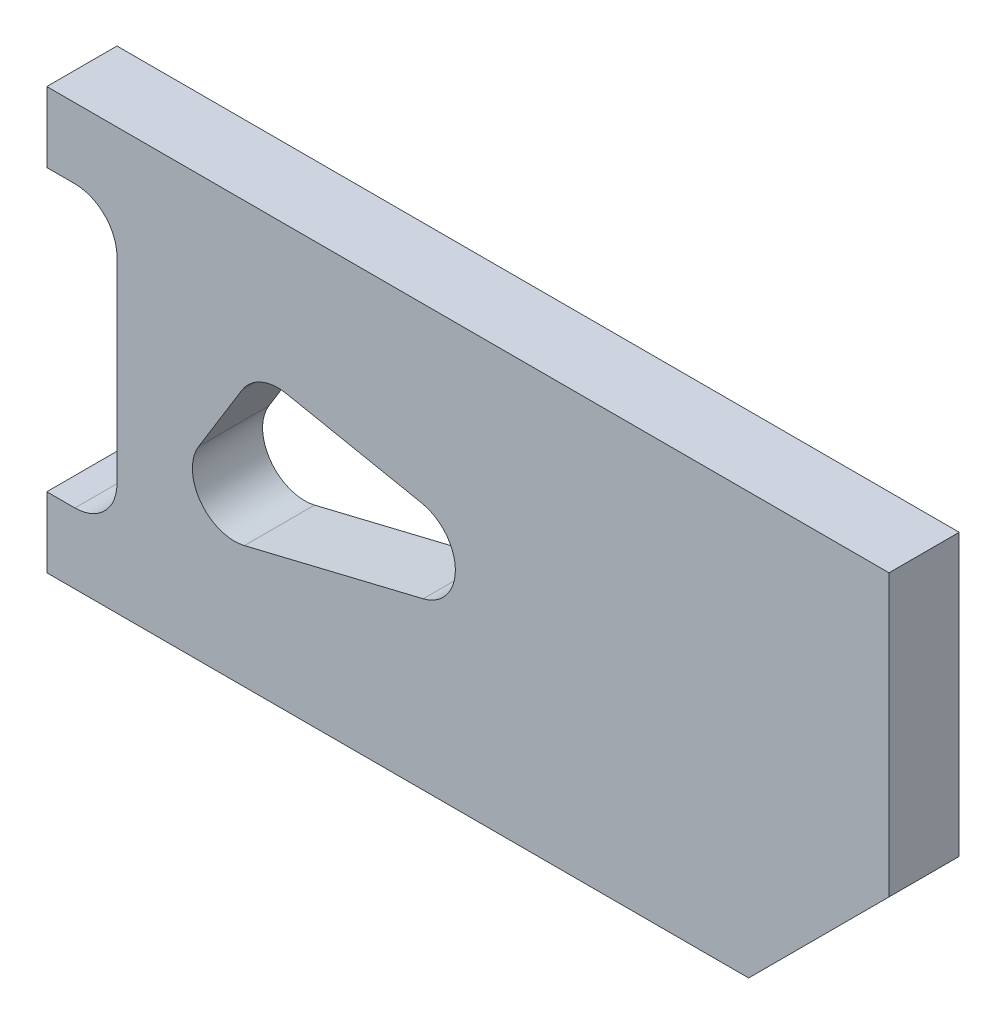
ISO-10303-21;
HEADER;
FILE_DESCRIPTION(('STEP AP214'),'2;1');
FILE_NAME('part.step','',(''),(''),'','','');
FILE_SCHEMA(('AUTOMOTIVE_DESIGN { 1 0 10303 214 1 1 1 1 }'));
ENDSEC;
DATA;
#1=APPLICATION_CONTEXT('core data for automotive mechanical design processes');
#2=APPLICATION_PROTOCOL_DEFINITION('international standard','automotive_design',2000,#1);
#3=PRODUCT_CONTEXT('',#1,'mechanical');
#4=PRODUCT('Part','Part','',(#3));
#5=PRODUCT_RELATED_PRODUCT_CATEGORY('part','',(#4));
#6=PRODUCT_DEFINITION_FORMATION('','',#4);
#7=PRODUCT_DEFINITION_CONTEXT('part definition',#1,'design');
#8=PRODUCT_DEFINITION('design','',#6,#7);
#9=PRODUCT_DEFINITION_SHAPE('','',#8);
#10=(LENGTH_UNIT() NAMED_UNIT(*) SI_UNIT(.MILLI.,.METRE.));
#11=(NAMED_UNIT(*) PLANE_ANGLE_UNIT() SI_UNIT($,.RADIAN.));
#12=(NAMED_UNIT(*) SI_UNIT($,.STERADIAN.) SOLID_ANGLE_UNIT());
#13=UNCERTAINTY_MEASURE_WITH_UNIT(LENGTH_MEASURE(1.E-05),#10,'distance_accuracy_value','');
#14=(GEOMETRIC_REPRESENTATION_CONTEXT(3) GLOBAL_UNCERTAINTY_ASSIGNED_CONTEXT((#13)) GLOBAL_UNIT_ASSIGNED_CONTEXT((#10,
#11,#12)) REPRESENTATION_CONTEXT('',''));
#15=CARTESIAN_POINT('',(0.,0.,0.));
#16=DIRECTION('',(0.,0.,1.));
#17=DIRECTION('',(1.,0.,0.));
#18=AXIS2_PLACEMENT_3D('',#15,#16,#17);
#19=CARTESIAN_POINT('',(26.107661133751,14.7190560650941,5.));
#20=DIRECTION('',(0.,0.,-1.));
#21=DIRECTION('',(-1.,0.,0.));
#22=AXIS2_PLACEMENT_3D('',#19,#20,#21);
#23=CYLINDRICAL_SURFACE('',#22,3.);
#24=CARTESIAN_POINT('',(26.107661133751,14.7190560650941,0.));
#25=DIRECTION('',(0.,0.,1.));
#26=DIRECTION('',(1.,0.,0.));
#27=AXIS2_PLACEMENT_3D('',#24,#25,#26);
#28=CIRCLE('',#27,3.);
#29=CARTESIAN_POINT('',(26.8144612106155,11.803505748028,0.));
#30=VERTEX_POINT('',#29);
#31=CARTESIAN_POINT('',(26.6960095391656,17.6607980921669,0.));
#32=VERTEX_POINT('',#31);
#33=EDGE_CURVE('E220',#30,#32,#28,.T.);
#34=ORIENTED_EDGE('',*,*,#33,.F.);
#35=DIRECTION('',(0.,0.,-1.));
#36=VECTOR('',#35,1.);
#37=CARTESIAN_POINT('',(26.8144612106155,11.803505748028,5.));
#38=LINE('',#37,#36);
#39=CARTESIAN_POINT('',(26.8144612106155,11.803505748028,5.));
#40=VERTEX_POINT('',#39);
#41=EDGE_CURVE('E11',#40,#30,#38,.T.);
#42=ORIENTED_EDGE('',*,*,#41,.F.);
#43=CARTESIAN_POINT('',(26.107661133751,14.7190560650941,5.));
#44=DIRECTION('',(0.,0.,1.));
#45=DIRECTION('',(1.,0.,0.));
#46=AXIS2_PLACEMENT_3D('',#43,#44,#45);
#47=CIRCLE('',#46,3.);
#48=CARTESIAN_POINT('',(26.6960095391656,17.6607980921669,5.));
#49=VERTEX_POINT('',#48);
#50=EDGE_CURVE('E309',#40,#49,#47,.T.);
#51=ORIENTED_EDGE('',*,*,#50,.T.);
#52=DIRECTION('',(0.,0.,-1.));
#53=VECTOR('',#52,1.);
#54=CARTESIAN_POINT('',(26.6960095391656,17.6607980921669,5.));
#55=LINE('',#54,#53);
#56=EDGE_CURVE('E117',#49,#32,#55,.T.);
#57=ORIENTED_EDGE('',*,*,#56,.T.);
#58=EDGE_LOOP('',(#34,#42,#51,#57));
#59=FACE_BOUND('',#58,.T.);
#60=ADVANCED_FACE('F37',(#59),#23,.F.);
#61=CARTESIAN_POINT('',(-1.21422376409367,5.00867302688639,5.));
#62=DIRECTION('',(0.235600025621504,-0.971850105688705,0.));
#63=DIRECTION('',(0.971850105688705,0.235600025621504,0.));
#64=AXIS2_PLACEMENT_3D('',#61,#62,#63);
#65=PLANE('',#64);
#66=DIRECTION('',(-0.971850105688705,-0.235600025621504,0.));
#67=VECTOR('',#66,1.);
#68=CARTESIAN_POINT('',(-1.21422376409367,5.00867302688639,0.));
#69=LINE('',#68,#67);
#70=CARTESIAN_POINT('',(14.0797039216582,8.71629185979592,0.));
#71=VERTEX_POINT('',#70);
#72=EDGE_CURVE('E223',#30,#71,#69,.T.);
#73=ORIENTED_EDGE('',*,*,#72,.T.);
#74=DIRECTION('',(0.,0.,-1.));
#75=VECTOR('',#74,1.);
#76=CARTESIAN_POINT('',(14.0797039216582,8.71629185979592,5.));
#77=LINE('',#76,#75);
#78=CARTESIAN_POINT('',(14.0797039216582,8.71629185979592,5.));
#79=VERTEX_POINT('',#78);
#80=EDGE_CURVE('E47',#79,#71,#77,.T.);
#81=ORIENTED_EDGE('',*,*,#80,.F.);
#82=DIRECTION('',(-0.971850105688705,-0.235600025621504,0.));
#83=VECTOR('',#82,1.);
#84=CARTESIAN_POINT('',(-1.21422376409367,5.00867302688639,5.));
#85=LINE('',#84,#83);
#86=EDGE_CURVE('E311',#40,#79,#85,.T.);
#87=ORIENTED_EDGE('',*,*,#86,.F.);
#88=ORIENTED_EDGE('',*,*,#41,.T.);
#89=EDGE_LOOP('',(#73,#81,#87,#88));
#90=FACE_BOUND('',#89,.T.);
#91=ADVANCED_FACE('F315',(#90),#65,.F.);
#92=CARTESIAN_POINT('',(13.3729038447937,11.631842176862,5.));
#93=DIRECTION('',(0.,0.,-1.));
#94=DIRECTION('',(-1.,0.,0.));
#95=AXIS2_PLACEMENT_3D('',#92,#93,#94);
#96=CYLINDRICAL_SURFACE('',#95,3.);
#97=CARTESIAN_POINT('',(13.3729038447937,11.631842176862,0.));
#98=DIRECTION('',(0.,0.,1.));
#99=DIRECTION('',(1.,0.,0.));
#100=AXIS2_PLACEMENT_3D('',#97,#98,#99);
#101=CIRCLE('',#100,3.);
#102=CARTESIAN_POINT('',(10.81792889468,13.204134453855,0.));
#103=VERTEX_POINT('',#102);
#104=EDGE_CURVE('E226',#71,#103,#101,.F.);
#105=ORIENTED_EDGE('',*,*,#104,.T.);
#106=DIRECTION('',(0.,0.,-1.));
#107=VECTOR('',#106,1.);
#108=CARTESIAN_POINT('',(10.81792889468,13.204134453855,5.));
#109=LINE('',#108,#107);
#110=CARTESIAN_POINT('',(10.81792889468,13.204134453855,5.));
#111=VERTEX_POINT('',#110);
#112=EDGE_CURVE('E183',#111,#103,#109,.T.);
#113=ORIENTED_EDGE('',*,*,#112,.F.);
#114=CARTESIAN_POINT('',(13.3729038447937,11.631842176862,5.));
#115=DIRECTION('',(0.,0.,1.));
#116=DIRECTION('',(1.,0.,0.));
#117=AXIS2_PLACEMENT_3D('',#114,#115,#116);
#118=CIRCLE('',#117,3.);
#119=EDGE_CURVE('E171',#79,#111,#118,.F.);
#120=ORIENTED_EDGE('',*,*,#119,.F.);
#121=ORIENTED_EDGE('',*,*,#80,.T.);
#122=EDGE_LOOP('',(#105,#113,#120,#121));
#123=FACE_BOUND('',#122,.T.);
#124=ADVANCED_FACE('F318',(#123),#96,.F.);
#125=CARTESIAN_POINT('',(1.95278969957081,-1.20171673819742,5.));
#126=DIRECTION('',(-0.851658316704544,0.524097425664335,0.));
#127=DIRECTION('',(-0.524097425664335,-0.851658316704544,0.));
#128=AXIS2_PLACEMENT_3D('',#125,#126,#127);
#129=PLANE('',#128);
#130=DIRECTION('',(0.524097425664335,0.851658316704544,0.));
#131=VECTOR('',#130,1.);
#132=CARTESIAN_POINT('',(1.95278969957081,-1.20171673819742,0.));
#133=LINE('',#132,#131);
#134=CARTESIAN_POINT('',(13.9051427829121,18.2208570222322,0.));
#135=VERTEX_POINT('',#134);
#136=EDGE_CURVE('E179',#103,#135,#133,.T.);
#137=ORIENTED_EDGE('',*,*,#136,.T.);
#138=DIRECTION('',(0.,0.,-1.));
#139=VECTOR('',#138,1.);
#140=CARTESIAN_POINT('',(13.9051427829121,18.2208570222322,5.));
#141=LINE('',#140,#139);
#142=CARTESIAN_POINT('',(13.9051427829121,18.2208570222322,5.));
#143=VERTEX_POINT('',#142);
#144=EDGE_CURVE('E177',#143,#135,#141,.T.);
#145=ORIENTED_EDGE('',*,*,#144,.F.);
#146=DIRECTION('',(0.524097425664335,0.851658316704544,0.));
#147=VECTOR('',#146,1.);
#148=CARTESIAN_POINT('',(1.95278969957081,-1.20171673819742,5.));
#149=LINE('',#148,#147);
#150=EDGE_CURVE('E165',#111,#143,#149,.T.);
#151=ORIENTED_EDGE('',*,*,#150,.F.);
#152=ORIENTED_EDGE('',*,*,#112,.T.);
#153=EDGE_LOOP('',(#137,#145,#151,#152));
#154=FACE_BOUND('',#153,.T.);
#155=ADVANCED_FACE('F178',(#154),#129,.F.);
#156=CARTESIAN_POINT('',(16.4601177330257,16.6485647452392,5.));
#157=DIRECTION('',(0.,0.,-1.));
#158=DIRECTION('',(-1.,0.,0.));
#159=AXIS2_PLACEMENT_3D('',#156,#157,#158);
#160=CYLINDRICAL_SURFACE('',#159,3.);
#161=CARTESIAN_POINT('',(16.4601177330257,16.6485647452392,0.));
#162=DIRECTION('',(0.,0.,1.));
#163=DIRECTION('',(1.,0.,0.));
#164=AXIS2_PLACEMENT_3D('',#161,#162,#163);
#165=CIRCLE('',#164,3.);
#166=CARTESIAN_POINT('',(17.0484661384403,19.5903067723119,0.));
#167=VERTEX_POINT('',#166);
#168=EDGE_CURVE('E230',#167,#135,#165,.T.);
#169=ORIENTED_EDGE('',*,*,#168,.F.);
#170=DIRECTION('',(0.,0.,-1.));
#171=VECTOR('',#170,1.);
#172=CARTESIAN_POINT('',(17.0484661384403,19.5903067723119,5.));
#173=LINE('',#172,#171);
#174=CARTESIAN_POINT('',(17.0484661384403,19.5903067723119,5.));
#175=VERTEX_POINT('',#174);
#176=EDGE_CURVE('E110',#175,#167,#173,.T.);
#177=ORIENTED_EDGE('',*,*,#176,.F.);
#178=CARTESIAN_POINT('',(16.4601177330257,16.6485647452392,5.));
#179=DIRECTION('',(0.,0.,1.));
#180=DIRECTION('',(1.,0.,0.));
#181=AXIS2_PLACEMENT_3D('',#178,#179,#180);
#182=CIRCLE('',#181,3.);
#183=EDGE_CURVE('E169',#175,#143,#182,.T.);
#184=ORIENTED_EDGE('',*,*,#183,.T.);
#185=ORIENTED_EDGE('',*,*,#144,.T.);
#186=EDGE_LOOP('',(#169,#177,#184,#185));
#187=FACE_BOUND('',#186,.T.);
#188=ADVANCED_FACE('F185',(#187),#160,.F.);
#189=CARTESIAN_POINT('',(2.,8.,5.));
#190=DIRECTION('',(0.,0.,-1.));
#191=DIRECTION('',(-1.,0.,0.));
#192=AXIS2_PLACEMENT_3D('',#189,#190,#191);
#193=CYLINDRICAL_SURFACE('',#192,3.);
#194=CARTESIAN_POINT('',(2.,8.,0.));
#195=DIRECTION('',(0.,0.,1.));
#196=DIRECTION('',(1.,0.,0.));
#197=AXIS2_PLACEMENT_3D('',#194,#195,#196);
#198=CIRCLE('',#197,3.);
#199=CARTESIAN_POINT('',(2.,5.,0.));
#200=VERTEX_POINT('',#199);
#201=CARTESIAN_POINT('',(5.,8.,0.));
#202=VERTEX_POINT('',#201);
#203=EDGE_CURVE('E191',#200,#202,#198,.T.);
#204=ORIENTED_EDGE('',*,*,#203,.F.);
#205=DIRECTION('',(0.,0.,-1.));
#206=VECTOR('',#205,1.);
#207=CARTESIAN_POINT('',(2.,5.,5.));
#208=LINE('',#207,#206);
#209=CARTESIAN_POINT('',(2.,5.,5.));
#210=VERTEX_POINT('',#209);
#211=EDGE_CURVE('E41',#210,#200,#208,.T.);
#212=ORIENTED_EDGE('',*,*,#211,.F.);
#213=CARTESIAN_POINT('',(2.,8.,5.));
#214=DIRECTION('',(0.,0.,1.));
#215=DIRECTION('',(1.,0.,0.));
#216=AXIS2_PLACEMENT_3D('',#213,#214,#215);
#217=CIRCLE('',#216,3.);
#218=CARTESIAN_POINT('',(5.,8.,5.));
#219=VERTEX_POINT('',#218);
#220=EDGE_CURVE('E234',#210,#219,#217,.T.);
#221=ORIENTED_EDGE('',*,*,#220,.T.);
#222=DIRECTION('',(0.,0.,-1.));
#223=VECTOR('',#222,1.);
#224=CARTESIAN_POINT('',(5.,8.,5.));
#225=LINE('',#224,#223);
#226=EDGE_CURVE('E187',#219,#202,#225,.T.);
#227=ORIENTED_EDGE('',*,*,#226,.T.);
#228=EDGE_LOOP('',(#204,#212,#221,#227));
#229=FACE_BOUND('',#228,.T.);
#230=ADVANCED_FACE('F39',(#229),#193,.F.);
#231=CARTESIAN_POINT('',(0.,5.,5.));
#232=DIRECTION('',(0.,1.,0.));
#233=DIRECTION('',(0.,0.,1.));
#234=AXIS2_PLACEMENT_3D('',#231,#232,#233);
#235=PLANE('',#234);
#236=DIRECTION('',(1.,0.,0.));
#237=VECTOR('',#236,1.);
#238=CARTESIAN_POINT('',(0.,5.,0.));
#239=LINE('',#238,#237);
#240=CARTESIAN_POINT('',(0.,5.,0.));
#241=VERTEX_POINT('',#240);
#242=EDGE_CURVE('E194',#241,#200,#239,.T.);
#243=ORIENTED_EDGE('',*,*,#242,.F.);
#244=DIRECTION('',(0.,0.,-1.));
#245=VECTOR('',#244,1.);
#246=CARTESIAN_POINT('',(0.,5.,5.));
#247=LINE('',#246,#245);
#248=CARTESIAN_POINT('',(0.,5.,5.));
#249=VERTEX_POINT('',#248);
#250=EDGE_CURVE('E258',#249,#241,#247,.T.);
#251=ORIENTED_EDGE('',*,*,#250,.F.);
#252=DIRECTION('',(1.,0.,0.));
#253=VECTOR('',#252,1.);
#254=CARTESIAN_POINT('',(0.,5.,5.));
#255=LINE('',#254,#253);
#256=EDGE_CURVE('E267',#249,#210,#255,.T.);
#257=ORIENTED_EDGE('',*,*,#256,.T.);
#258=ORIENTED_EDGE('',*,*,#211,.T.);
#259=EDGE_LOOP('',(#243,#251,#257,#258));
#260=FACE_BOUND('',#259,.T.);
#261=ADVANCED_FACE('F265',(#260),#235,.T.);
#262=CARTESIAN_POINT('',(0.,0.,5.));
#263=DIRECTION('',(-1.,0.,0.));
#264=DIRECTION('',(0.,0.,1.));
#265=AXIS2_PLACEMENT_3D('',#262,#263,#264);
#266=PLANE('',#265);
#267=DIRECTION('',(0.,1.,0.));
#268=VECTOR('',#267,1.);
#269=CARTESIAN_POINT('',(0.,0.,0.));
#270=LINE('',#269,#268);
#271=CARTESIAN_POINT('',(0.,0.,0.));
#272=VERTEX_POINT('',#271);
#273=EDGE_CURVE('E197',#272,#241,#270,.T.);
#274=ORIENTED_EDGE('',*,*,#273,.F.);
#275=DIRECTION('',(0.,0.,-1.));
#276=VECTOR('',#275,1.);
#277=CARTESIAN_POINT('',(0.,0.,5.));
#278=LINE('',#277,#276);
#279=CARTESIAN_POINT('',(0.,0.,5.));
#280=VERTEX_POINT('',#279);
#281=EDGE_CURVE('E257',#280,#272,#278,.T.);
#282=ORIENTED_EDGE('',*,*,#281,.F.);
#283=DIRECTION('',(0.,1.,0.));
#284=VECTOR('',#283,1.);
#285=CARTESIAN_POINT('',(0.,0.,5.));
#286=LINE('',#285,#284);
#287=EDGE_CURVE('E278',#280,#249,#286,.T.);
#288=ORIENTED_EDGE('',*,*,#287,.T.);
#289=ORIENTED_EDGE('',*,*,#250,.T.);
#290=EDGE_LOOP('',(#274,#282,#288,#289));
#291=FACE_BOUND('',#290,.T.);
#292=ADVANCED_FACE('F275',(#291),#266,.T.);
#293=CARTESIAN_POINT('',(0.,0.,5.));
#294=DIRECTION('',(0.,1.,0.));
#295=DIRECTION('',(0.,0.,1.));
#296=AXIS2_PLACEMENT_3D('',#293,#294,#295);
#297=PLANE('',#296);
#298=DIRECTION('',(1.,0.,0.));
#299=VECTOR('',#298,1.);
#300=CARTESIAN_POINT('',(0.,0.,0.));
#301=LINE('',#300,#299);
#302=CARTESIAN_POINT('',(50.,0.,0.));
#303=VERTEX_POINT('',#302);
#304=EDGE_CURVE('E200',#272,#303,#301,.T.);
#305=ORIENTED_EDGE('',*,*,#304,.T.);
#306=DIRECTION('',(0.,0.,-1.));
#307=VECTOR('',#306,1.);
#308=CARTESIAN_POINT('',(50.,0.,5.));
#309=LINE('',#308,#307);
#310=CARTESIAN_POINT('',(50.,0.,5.));
#311=VERTEX_POINT('',#310);
#312=EDGE_CURVE('E254',#311,#303,#309,.T.);
#313=ORIENTED_EDGE('',*,*,#312,.F.);
#314=DIRECTION('',(1.,0.,0.));
#315=VECTOR('',#314,1.);
#316=CARTESIAN_POINT('',(0.,0.,5.));
#317=LINE('',#316,#315);
#318=EDGE_CURVE('E281',#280,#311,#317,.T.);
#319=ORIENTED_EDGE('',*,*,#318,.F.);
#320=ORIENTED_EDGE('',*,*,#281,.T.);
#321=EDGE_LOOP('',(#305,#313,#319,#320));
#322=FACE_BOUND('',#321,.T.);
#323=ADVANCED_FACE('F282',(#322),#297,.F.);
#324=CARTESIAN_POINT('',(25.,-25.,5.));
#325=DIRECTION('',(-0.707106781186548,0.707106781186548,0.));
#326=DIRECTION('',(-0.707106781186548,-0.707106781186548,0.));
#327=AXIS2_PLACEMENT_3D('',#324,#325,#326);
#328=PLANE('',#327);
#329=DIRECTION('',(0.707106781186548,0.707106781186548,0.));
#330=VECTOR('',#329,1.);
#331=CARTESIAN_POINT('',(25.,-25.,0.));
#332=LINE('',#331,#330);
#333=CARTESIAN_POINT('',(60.,10.,0.));
#334=VERTEX_POINT('',#333);
#335=EDGE_CURVE('E203',#303,#334,#332,.T.);
#336=ORIENTED_EDGE('',*,*,#335,.T.);
#337=DIRECTION('',(0.,0.,-1.));
#338=VECTOR('',#337,1.);
#339=CARTESIAN_POINT('',(60.,10.,5.));
#340=LINE('',#339,#338);
#341=CARTESIAN_POINT('',(60.,10.,5.));
#342=VERTEX_POINT('',#341);
#343=EDGE_CURVE('E251',#342,#334,#340,.T.);
#344=ORIENTED_EDGE('',*,*,#343,.F.);
#345=DIRECTION('',(0.707106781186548,0.707106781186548,0.));
#346=VECTOR('',#345,1.);
#347=CARTESIAN_POINT('',(25.,-25.,5.));
#348=LINE('',#347,#346);
#349=EDGE_CURVE('E285',#311,#342,#348,.T.);
#350=ORIENTED_EDGE('',*,*,#349,.F.);
#351=ORIENTED_EDGE('',*,*,#312,.T.);
#352=EDGE_LOOP('',(#336,#344,#350,#351));
#353=FACE_BOUND('',#352,.T.);
#354=ADVANCED_FACE('F349',(#353),#328,.F.);
#355=CARTESIAN_POINT('',(60.,0.,5.));
#356=DIRECTION('',(-1.,0.,0.));
#357=DIRECTION('',(0.,0.,1.));
#358=AXIS2_PLACEMENT_3D('',#355,#356,#357);
#359=PLANE('',#358);
#360=DIRECTION('',(0.,1.,0.));
#361=VECTOR('',#360,1.);
#362=CARTESIAN_POINT('',(60.,0.,0.));
#363=LINE('',#362,#361);
#364=CARTESIAN_POINT('',(60.,30.,0.));
#365=VERTEX_POINT('',#364);
#366=EDGE_CURVE('E205',#334,#365,#363,.T.);
#367=ORIENTED_EDGE('',*,*,#366,.T.);
#368=DIRECTION('',(0.,0.,-1.));
#369=VECTOR('',#368,1.);
#370=CARTESIAN_POINT('',(60.,30.,5.));
#371=LINE('',#370,#369);
#372=CARTESIAN_POINT('',(60.,30.,5.));
#373=VERTEX_POINT('',#372);
#374=EDGE_CURVE('E249',#373,#365,#371,.T.);
#375=ORIENTED_EDGE('',*,*,#374,.F.);
#376=DIRECTION('',(0.,1.,0.));
#377=VECTOR('',#376,1.);
#378=CARTESIAN_POINT('',(60.,0.,5.));
#379=LINE('',#378,#377);
#380=EDGE_CURVE('E298',#342,#373,#379,.T.);
#381=ORIENTED_EDGE('',*,*,#380,.F.);
#382=ORIENTED_EDGE('',*,*,#343,.T.);
#383=EDGE_LOOP('',(#367,#375,#381,#382));
#384=FACE_BOUND('',#383,.T.);
#385=ADVANCED_FACE('F346',(#384),#359,.F.);
#386=CARTESIAN_POINT('',(0.,30.,5.));
#387=DIRECTION('',(0.,1.,0.));
#388=DIRECTION('',(0.,0.,1.));
#389=AXIS2_PLACEMENT_3D('',#386,#387,#388);
#390=PLANE('',#389);
#391=DIRECTION('',(1.,0.,0.));
#392=VECTOR('',#391,1.);
#393=CARTESIAN_POINT('',(0.,30.,0.));
#394=LINE('',#393,#392);
#395=CARTESIAN_POINT('',(0.,30.,0.));
#396=VERTEX_POINT('',#395);
#397=EDGE_CURVE('E208',#396,#365,#394,.T.);
#398=ORIENTED_EDGE('',*,*,#397,.F.);
#399=DIRECTION('',(0.,0.,-1.));
#400=VECTOR('',#399,1.);
#401=CARTESIAN_POINT('',(0.,30.,5.));
#402=LINE('',#401,#400);
#403=CARTESIAN_POINT('',(0.,30.,5.));
#404=VERTEX_POINT('',#403);
#405=EDGE_CURVE('E247',#404,#396,#402,.T.);
#406=ORIENTED_EDGE('',*,*,#405,.F.);
#407=DIRECTION('',(1.,0.,0.));
#408=VECTOR('',#407,1.);
#409=CARTESIAN_POINT('',(0.,30.,5.));
#410=LINE('',#409,#408);
#411=EDGE_CURVE('E292',#404,#373,#410,.T.);
#412=ORIENTED_EDGE('',*,*,#411,.T.);
#413=ORIENTED_EDGE('',*,*,#374,.T.);
#414=EDGE_LOOP('',(#398,#406,#412,#413));
#415=FACE_BOUND('',#414,.T.);
#416=ADVANCED_FACE('F343',(#415),#390,.T.);
#417=CARTESIAN_POINT('',(0.,25.,0.));
#418=VERTEX_POINT('',#417);
#419=EDGE_CURVE('E201',#418,#396,#270,.T.);
#420=ORIENTED_EDGE('',*,*,#419,.F.);
#421=DIRECTION('',(0.,0.,-1.));
#422=VECTOR('',#421,1.);
#423=CARTESIAN_POINT('',(0.,25.,5.));
#424=LINE('',#423,#422);
#425=CARTESIAN_POINT('',(0.,25.,5.));
#426=VERTEX_POINT('',#425);
#427=EDGE_CURVE('E245',#426,#418,#424,.T.);
#428=ORIENTED_EDGE('',*,*,#427,.F.);
#429=EDGE_CURVE('E288',#426,#404,#286,.T.);
#430=ORIENTED_EDGE('',*,*,#429,.T.);
#431=ORIENTED_EDGE('',*,*,#405,.T.);
#432=EDGE_LOOP('',(#420,#428,#430,#431));
#433=FACE_BOUND('',#432,.T.);
#434=ADVANCED_FACE('F339',(#433),#266,.T.);
#435=CARTESIAN_POINT('',(0.,25.,5.));
#436=DIRECTION('',(0.,1.,0.));
#437=DIRECTION('',(-1.,0.,0.));
#438=AXIS2_PLACEMENT_3D('',#435,#436,#437);
#439=PLANE('',#438);
#440=DIRECTION('',(1.,0.,0.));
#441=VECTOR('',#440,1.);
#442=CARTESIAN_POINT('',(0.,25.,0.));
#443=LINE('',#442,#441);
#444=CARTESIAN_POINT('',(2.,25.,0.));
#445=VERTEX_POINT('',#444);
#446=EDGE_CURVE('E211',#418,#445,#443,.T.);
#447=ORIENTED_EDGE('',*,*,#446,.T.);
#448=DIRECTION('',(0.,0.,-1.));
#449=VECTOR('',#448,1.);
#450=CARTESIAN_POINT('',(2.,25.,5.));
#451=LINE('',#450,#449);
#452=CARTESIAN_POINT('',(2.,25.,5.));
#453=VERTEX_POINT('',#452);
#454=EDGE_CURVE('E243',#453,#445,#451,.T.);
#455=ORIENTED_EDGE('',*,*,#454,.F.);
#456=DIRECTION('',(1.,0.,0.));
#457=VECTOR('',#456,1.);
#458=CARTESIAN_POINT('',(0.,25.,5.));
#459=LINE('',#458,#457);
#460=EDGE_CURVE('E291',#426,#453,#459,.T.);
#461=ORIENTED_EDGE('',*,*,#460,.F.);
#462=ORIENTED_EDGE('',*,*,#427,.T.);
#463=EDGE_LOOP('',(#447,#455,#461,#462));
#464=FACE_BOUND('',#463,.T.);
#465=ADVANCED_FACE('F335',(#464),#439,.F.);
#466=CARTESIAN_POINT('',(2.,22.,5.));
#467=DIRECTION('',(0.,0.,-1.));
#468=DIRECTION('',(-1.,0.,0.));
#469=AXIS2_PLACEMENT_3D('',#466,#467,#468);
#470=CYLINDRICAL_SURFACE('',#469,3.);
#471=CARTESIAN_POINT('',(2.,22.,0.));
#472=DIRECTION('',(0.,0.,1.));
#473=DIRECTION('',(1.,0.,0.));
#474=AXIS2_PLACEMENT_3D('',#471,#472,#473);
#475=CIRCLE('',#474,3.);
#476=CARTESIAN_POINT('',(5.,22.,0.));
#477=VERTEX_POINT('',#476);
#478=EDGE_CURVE('E214',#477,#445,#475,.T.);
#479=ORIENTED_EDGE('',*,*,#478,.F.);
#480=DIRECTION('',(0.,0.,-1.));
#481=VECTOR('',#480,1.);
#482=CARTESIAN_POINT('',(5.,22.,5.));
#483=LINE('',#482,#481);
#484=CARTESIAN_POINT('',(5.,22.,5.));
#485=VERTEX_POINT('',#484);
#486=EDGE_CURVE('E241',#485,#477,#483,.T.);
#487=ORIENTED_EDGE('',*,*,#486,.F.);
#488=CARTESIAN_POINT('',(2.,22.,5.));
#489=DIRECTION('',(0.,0.,1.));
#490=DIRECTION('',(1.,0.,0.));
#491=AXIS2_PLACEMENT_3D('',#488,#489,#490);
#492=CIRCLE('',#491,3.);
#493=EDGE_CURVE('E295',#485,#453,#492,.T.);
#494=ORIENTED_EDGE('',*,*,#493,.T.);
#495=ORIENTED_EDGE('',*,*,#454,.T.);
#496=EDGE_LOOP('',(#479,#487,#494,#495));
#497=FACE_BOUND('',#496,.T.);
#498=ADVANCED_FACE('F331',(#497),#470,.F.);
#499=CARTESIAN_POINT('',(5.,0.,5.));
#500=DIRECTION('',(1.,0.,0.));
#501=DIRECTION('',(0.,1.,0.));
#502=AXIS2_PLACEMENT_3D('',#499,#500,#501);
#503=PLANE('',#502);
#504=DIRECTION('',(0.,-1.,0.));
#505=VECTOR('',#504,1.);
#506=CARTESIAN_POINT('',(5.,0.,0.));
#507=LINE('',#506,#505);
#508=EDGE_CURVE('E217',#477,#202,#507,.T.);
#509=ORIENTED_EDGE('',*,*,#508,.T.);
#510=ORIENTED_EDGE('',*,*,#226,.F.);
#511=DIRECTION('',(0.,-1.,0.));
#512=VECTOR('',#511,1.);
#513=CARTESIAN_POINT('',(5.,0.,5.));
#514=LINE('',#513,#512);
#515=EDGE_CURVE('E307',#485,#219,#514,.T.);
#516=ORIENTED_EDGE('',*,*,#515,.F.);
#517=ORIENTED_EDGE('',*,*,#486,.T.);
#518=EDGE_LOOP('',(#509,#510,#516,#517));
#519=FACE_BOUND('',#518,.T.);
#520=ADVANCED_FACE('F328',(#519),#503,.F.);
#521=CARTESIAN_POINT('',(4.42307692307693,22.1153846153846,5.));
#522=DIRECTION('',(0.196116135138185,0.98058067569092,0.));
#523=DIRECTION('',(-0.98058067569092,0.196116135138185,0.));
#524=AXIS2_PLACEMENT_3D('',#521,#522,#523);
#525=PLANE('',#524);
#526=DIRECTION('',(0.98058067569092,-0.196116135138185,0.));
#527=VECTOR('',#526,1.);
#528=CARTESIAN_POINT('',(4.42307692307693,22.1153846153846,0.));
#529=LINE('',#528,#527);
#530=EDGE_CURVE('E232',#167,#32,#529,.T.);
#531=ORIENTED_EDGE('',*,*,#530,.T.);
#532=ORIENTED_EDGE('',*,*,#56,.F.);
#533=DIRECTION('',(0.98058067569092,-0.196116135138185,0.));
#534=VECTOR('',#533,1.);
#535=CARTESIAN_POINT('',(4.42307692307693,22.1153846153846,5.));
#536=LINE('',#535,#534);
#537=EDGE_CURVE('E56',#175,#49,#536,.T.);
#538=ORIENTED_EDGE('',*,*,#537,.F.);
#539=ORIENTED_EDGE('',*,*,#176,.T.);
#540=EDGE_LOOP('',(#531,#532,#538,#539));
#541=FACE_BOUND('',#540,.T.);
#542=ADVANCED_FACE('F319',(#541),#525,.F.);
#543=CARTESIAN_POINT('',(0.,0.,5.));
#544=DIRECTION('',(0.,0.,1.));
#545=DIRECTION('',(1.,0.,0.));
#546=AXIS2_PLACEMENT_3D('',#543,#544,#545);
#547=PLANE('',#546);
#548=ORIENTED_EDGE('',*,*,#220,.F.);
#549=ORIENTED_EDGE('',*,*,#256,.F.);
#550=ORIENTED_EDGE('',*,*,#287,.F.);
#551=ORIENTED_EDGE('',*,*,#318,.T.);
#552=ORIENTED_EDGE('',*,*,#349,.T.);
#553=ORIENTED_EDGE('',*,*,#380,.T.);
#554=ORIENTED_EDGE('',*,*,#411,.F.);
#555=ORIENTED_EDGE('',*,*,#429,.F.);
#556=ORIENTED_EDGE('',*,*,#460,.T.);
#557=ORIENTED_EDGE('',*,*,#493,.F.);
#558=ORIENTED_EDGE('',*,*,#515,.T.);
#559=EDGE_LOOP('',(#548,#549,#550,#551,#552,#553,#554,#555,#556,#557,#558));
#560=FACE_BOUND('',#559,.T.);
#561=ORIENTED_EDGE('',*,*,#50,.F.);
#562=ORIENTED_EDGE('',*,*,#86,.T.);
#563=ORIENTED_EDGE('',*,*,#119,.T.);
#564=ORIENTED_EDGE('',*,*,#150,.T.);
#565=ORIENTED_EDGE('',*,*,#183,.F.);
#566=ORIENTED_EDGE('',*,*,#537,.T.);
#567=EDGE_LOOP('',(#561,#562,#563,#564,#565,#566));
#568=FACE_BOUND('',#567,.T.);
#569=ADVANCED_FACE('F167',(#560,#568),#547,.T.);
#570=CARTESIAN_POINT('',(0.,0.,0.));
#571=DIRECTION('',(0.,0.,1.));
#572=DIRECTION('',(1.,0.,0.));
#573=AXIS2_PLACEMENT_3D('',#570,#571,#572);
#574=PLANE('',#573);
#575=ORIENTED_EDGE('',*,*,#203,.T.);
#576=ORIENTED_EDGE('',*,*,#508,.F.);
#577=ORIENTED_EDGE('',*,*,#478,.T.);
#578=ORIENTED_EDGE('',*,*,#446,.F.);
#579=ORIENTED_EDGE('',*,*,#419,.T.);
#580=ORIENTED_EDGE('',*,*,#397,.T.);
#581=ORIENTED_EDGE('',*,*,#366,.F.);
#582=ORIENTED_EDGE('',*,*,#335,.F.);
#583=ORIENTED_EDGE('',*,*,#304,.F.);
#584=ORIENTED_EDGE('',*,*,#273,.T.);
#585=ORIENTED_EDGE('',*,*,#242,.T.);
#586=EDGE_LOOP('',(#575,#576,#577,#578,#579,#580,#581,#582,#583,#584,#585));
#587=FACE_BOUND('',#586,.T.);
#588=ORIENTED_EDGE('',*,*,#33,.T.);
#589=ORIENTED_EDGE('',*,*,#530,.F.);
#590=ORIENTED_EDGE('',*,*,#168,.T.);
#591=ORIENTED_EDGE('',*,*,#136,.F.);
#592=ORIENTED_EDGE('',*,*,#104,.F.);
#593=ORIENTED_EDGE('',*,*,#72,.F.);
#594=EDGE_LOOP('',(#588,#589,#590,#591,#592,#593));
#595=FACE_BOUND('',#594,.T.);
#596=ADVANCED_FACE('F271',(#587,#595),#574,.F.);
#597=CLOSED_SHELL('',(#60,#91,#124,#155,#188,#230,#261,#292,#323,#354,#385,#416,#434,#465,#498,
#520,#542,#569,#596));
#598=MANIFOLD_SOLID_BREP('B2',#597);
#599=ADVANCED_BREP_SHAPE_REPRESENTATION('',(#18,#598),#14);
#600=SHAPE_DEFINITION_REPRESENTATION(#9,#599);
ENDSEC;
END-ISO-10303-21;
